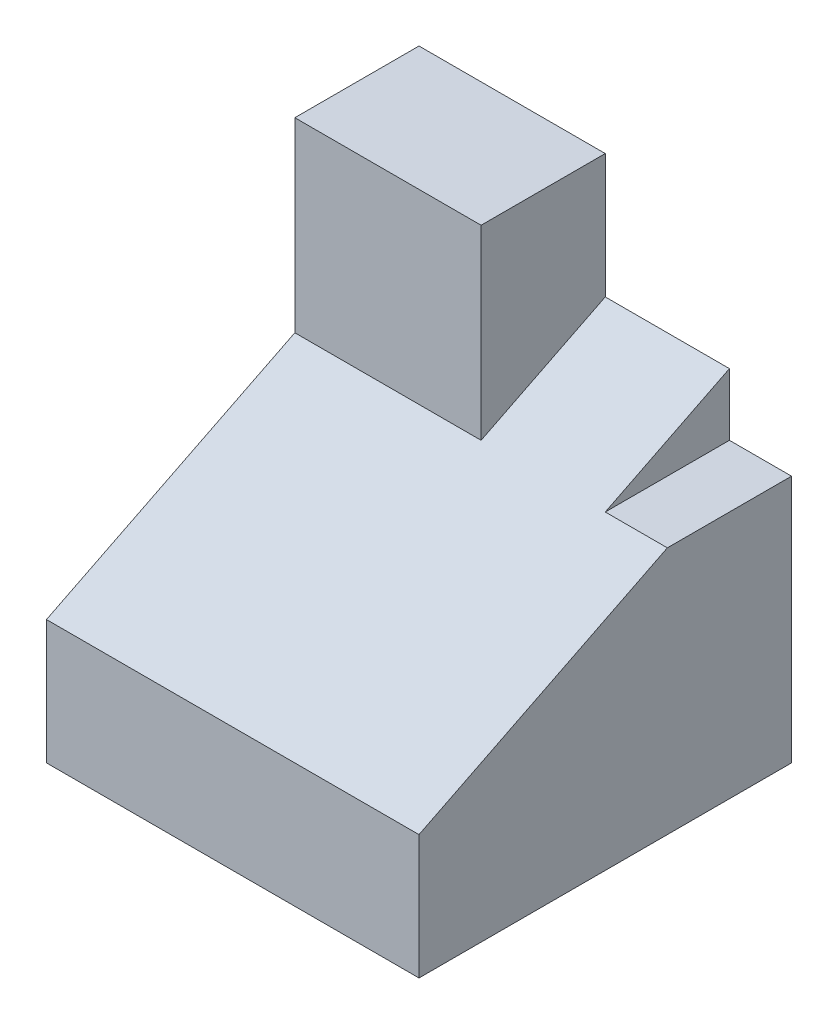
from build123d import *

# Parameters (mm, degrees)
CROQUIS1_W              = 60
CROQUIS1_H              = 70
SALIENTE_EXTRUIR1_DEPTH = 30
CORTAR_EXTRUIR1_DEPTH   = 76.663729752
CORTAR_EXTRUIR2_DEPTH   = 30
CORTAR_EXTRUIR3_DEPTH   = 10


with BuildPart() as part:
    # Croquis1 → Saliente-Extruir1 (new, symmetric)
    with BuildSketch(Plane.XY):
        Rectangle(CROQUIS1_W, CROQUIS1_H)
    extrude(amount=SALIENTE_EXTRUIR1_DEPTH, both=True)

    # Croquis2 → Cortar-Extruir1 (cut, through all)
    with BuildSketch(Plane(origin=(30, 0, 0), x_dir=(0, 0, -1), z_dir=(1, 0, 0))):
        Polygon((10, 35), (10, 5), (-30, -15), (-30, 35), align=None)
    extrude(amount=-CORTAR_EXTRUIR1_DEPTH, mode=Mode.SUBTRACT)

    # Croquis3 → Cortar-Extruir2 (cut)
    with BuildSketch(Plane(origin=(30, 0, 0), x_dir=(0, 0, -1), z_dir=(1, 0, 0))):
        Polygon((10, 5), (30, 15), (30, 35), (10, 35), align=None)
    extrude(amount=-CORTAR_EXTRUIR2_DEPTH, mode=Mode.SUBTRACT)

    # Croquis4 → Cortar-Extruir3 (cut)
    with BuildSketch(Plane(origin=(30, 0, 0), x_dir=(0, 0, -1), z_dir=(1, 0, 0))):
        Polygon((30, 15), (10, 5), (30, 5), align=None)
    extrude(amount=-CORTAR_EXTRUIR3_DEPTH, mode=Mode.SUBTRACT)


solid = part.part
